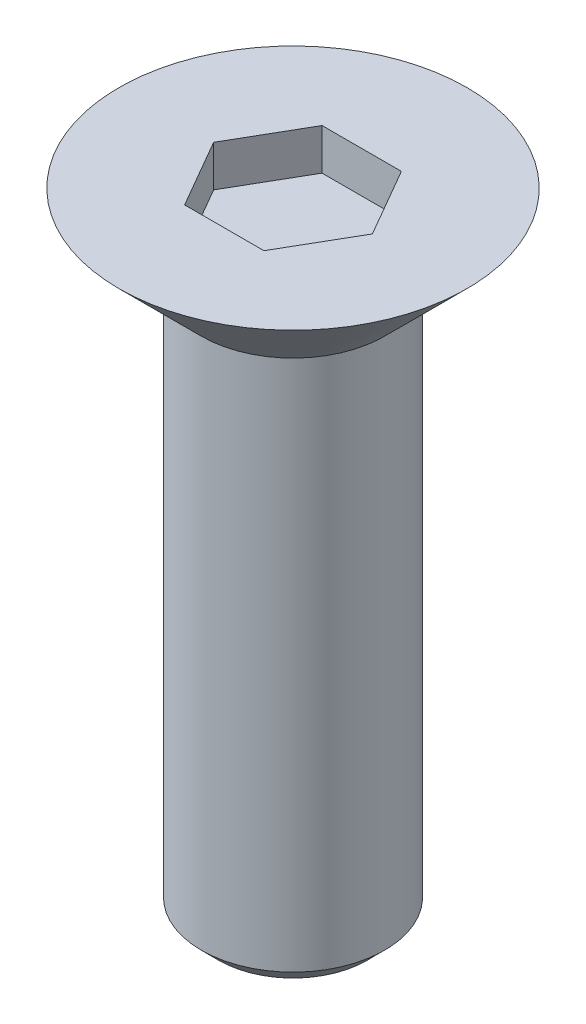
ISO-10303-21;
HEADER;
FILE_DESCRIPTION(('STEP AP214'),'2;1');
FILE_NAME('part.step','',(''),(''),'','','');
FILE_SCHEMA(('AUTOMOTIVE_DESIGN { 1 0 10303 214 1 1 1 1 }'));
ENDSEC;
DATA;
#1=APPLICATION_CONTEXT('core data for automotive mechanical design processes');
#2=APPLICATION_PROTOCOL_DEFINITION('international standard','automotive_design',2000,#1);
#3=PRODUCT_CONTEXT('',#1,'mechanical');
#4=PRODUCT('Part','Part','',(#3));
#5=PRODUCT_RELATED_PRODUCT_CATEGORY('part','',(#4));
#6=PRODUCT_DEFINITION_FORMATION('','',#4);
#7=PRODUCT_DEFINITION_CONTEXT('part definition',#1,'design');
#8=PRODUCT_DEFINITION('design','',#6,#7);
#9=PRODUCT_DEFINITION_SHAPE('','',#8);
#10=(LENGTH_UNIT() NAMED_UNIT(*) SI_UNIT(.MILLI.,.METRE.));
#11=(NAMED_UNIT(*) PLANE_ANGLE_UNIT() SI_UNIT($,.RADIAN.));
#12=(NAMED_UNIT(*) SI_UNIT($,.STERADIAN.) SOLID_ANGLE_UNIT());
#13=UNCERTAINTY_MEASURE_WITH_UNIT(LENGTH_MEASURE(1.E-05),#10,'distance_accuracy_value','');
#14=(GEOMETRIC_REPRESENTATION_CONTEXT(3) GLOBAL_UNCERTAINTY_ASSIGNED_CONTEXT((#13)) GLOBAL_UNIT_ASSIGNED_CONTEXT((#10,
#11,#12)) REPRESENTATION_CONTEXT('',''));
#15=CARTESIAN_POINT('',(0.,0.,0.));
#16=DIRECTION('',(0.,0.,1.));
#17=DIRECTION('',(1.,0.,0.));
#18=AXIS2_PLACEMENT_3D('',#15,#16,#17);
#19=CARTESIAN_POINT('',(0.,0.,0.));
#20=DIRECTION('',(0.,1.,0.));
#21=DIRECTION('',(0.,0.,1.));
#22=AXIS2_PLACEMENT_3D('',#19,#20,#21);
#23=CONICAL_SURFACE('',#22,3.8,0.78539816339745);
#24=CARTESIAN_POINT('',(0.,-1.8,0.));
#25=DIRECTION('',(0.,-1.,0.));
#26=DIRECTION('',(0.,0.,-1.));
#27=AXIS2_PLACEMENT_3D('',#24,#25,#26);
#28=CIRCLE('',#27,2.);
#29=CARTESIAN_POINT('',(0.,-1.8,2.));
#30=VERTEX_POINT('',#29);
#31=EDGE_CURVE('E133',#30,#30,#28,.T.);
#32=ORIENTED_EDGE('',*,*,#31,.F.);
#33=EDGE_LOOP('',(#32));
#34=FACE_BOUND('',#33,.T.);
#35=CARTESIAN_POINT('',(0.,0.,0.));
#36=DIRECTION('',(0.,1.,0.));
#37=DIRECTION('',(0.,0.,1.));
#38=AXIS2_PLACEMENT_3D('',#35,#36,#37);
#39=CIRCLE('',#38,3.8);
#40=CARTESIAN_POINT('',(0.,0.,3.8));
#41=VERTEX_POINT('',#40);
#42=EDGE_CURVE('E142',#41,#41,#39,.T.);
#43=ORIENTED_EDGE('',*,*,#42,.F.);
#44=EDGE_LOOP('',(#43));
#45=FACE_BOUND('',#44,.T.);
#46=ADVANCED_FACE('F31',(#34,#45),#23,.T.);
#47=CARTESIAN_POINT('',(0.,0.,0.));
#48=DIRECTION('',(0.,1.,0.));
#49=DIRECTION('',(0.,0.,1.));
#50=AXIS2_PLACEMENT_3D('',#47,#48,#49);
#51=PLANE('',#50);
#52=DIRECTION('',(0.5,0.,-0.866025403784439));
#53=VECTOR('',#52,1.);
#54=CARTESIAN_POINT('',(0.866025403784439,0.,1.5));
#55=LINE('',#54,#53);
#56=CARTESIAN_POINT('',(0.866025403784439,0.,1.5));
#57=VERTEX_POINT('',#56);
#58=CARTESIAN_POINT('',(1.73205080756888,0.,0.));
#59=VERTEX_POINT('',#58);
#60=EDGE_CURVE('E45',#57,#59,#55,.T.);
#61=ORIENTED_EDGE('',*,*,#60,.F.);
#62=DIRECTION('',(1.,0.,0.));
#63=VECTOR('',#62,1.);
#64=CARTESIAN_POINT('',(-0.86602540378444,0.,1.5));
#65=LINE('',#64,#63);
#66=CARTESIAN_POINT('',(-0.86602540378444,0.,1.5));
#67=VERTEX_POINT('',#66);
#68=EDGE_CURVE('E115',#67,#57,#65,.T.);
#69=ORIENTED_EDGE('',*,*,#68,.F.);
#70=DIRECTION('',(0.5,0.,0.866025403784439));
#71=VECTOR('',#70,1.);
#72=CARTESIAN_POINT('',(-1.73205080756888,0.,0.));
#73=LINE('',#72,#71);
#74=CARTESIAN_POINT('',(-1.73205080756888,0.,0.));
#75=VERTEX_POINT('',#74);
#76=EDGE_CURVE('E109',#75,#67,#73,.T.);
#77=ORIENTED_EDGE('',*,*,#76,.F.);
#78=DIRECTION('',(-0.5,0.,0.866025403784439));
#79=VECTOR('',#78,1.);
#80=CARTESIAN_POINT('',(-0.866025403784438,0.,-1.5));
#81=LINE('',#80,#79);
#82=CARTESIAN_POINT('',(-0.866025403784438,0.,-1.5));
#83=VERTEX_POINT('',#82);
#84=EDGE_CURVE('E107',#83,#75,#81,.T.);
#85=ORIENTED_EDGE('',*,*,#84,.F.);
#86=DIRECTION('',(-1.,0.,0.));
#87=VECTOR('',#86,1.);
#88=CARTESIAN_POINT('',(0.866025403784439,0.,-1.5));
#89=LINE('',#88,#87);
#90=CARTESIAN_POINT('',(0.866025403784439,0.,-1.5));
#91=VERTEX_POINT('',#90);
#92=EDGE_CURVE('E88',#91,#83,#89,.T.);
#93=ORIENTED_EDGE('',*,*,#92,.F.);
#94=DIRECTION('',(-0.5,0.,-0.866025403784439));
#95=VECTOR('',#94,1.);
#96=CARTESIAN_POINT('',(1.73205080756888,0.,0.));
#97=LINE('',#96,#95);
#98=EDGE_CURVE('E99',#59,#91,#97,.T.);
#99=ORIENTED_EDGE('',*,*,#98,.F.);
#100=EDGE_LOOP('',(#61,#69,#77,#85,#93,#99));
#101=FACE_BOUND('',#100,.T.);
#102=ORIENTED_EDGE('',*,*,#42,.T.);
#103=EDGE_LOOP('',(#102));
#104=FACE_BOUND('',#103,.T.);
#105=ADVANCED_FACE('F103',(#101,#104),#51,.T.);
#106=CARTESIAN_POINT('',(0.,-13.7888,0.));
#107=DIRECTION('',(0.,1.,0.));
#108=DIRECTION('',(0.,0.,1.));
#109=AXIS2_PLACEMENT_3D('',#106,#107,#108);
#110=CYLINDRICAL_SURFACE('',#109,2.);
#111=CARTESIAN_POINT('',(0.,-13.4078,0.));
#112=DIRECTION('',(0.,-1.,0.));
#113=DIRECTION('',(0.,0.,-1.));
#114=AXIS2_PLACEMENT_3D('',#111,#112,#113);
#115=CIRCLE('',#114,2.);
#116=CARTESIAN_POINT('',(0.,-13.4078,2.));
#117=VERTEX_POINT('',#116);
#118=EDGE_CURVE('E11',#117,#117,#115,.F.);
#119=CARTESIAN_POINT('',(0.,-13.4078,2.));
#120=CARTESIAN_POINT('',(0.,-13.2868854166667,2.));
#121=CARTESIAN_POINT('',(0.,-13.1659708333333,2.));
#122=CARTESIAN_POINT('',(0.,-12.9241416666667,2.));
#123=CARTESIAN_POINT('',(0.,-12.8032270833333,2.));
#124=CARTESIAN_POINT('',(0.,-12.5613979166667,2.));
#125=CARTESIAN_POINT('',(0.,-12.4404833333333,2.));
#126=CARTESIAN_POINT('',(0.,-12.1986541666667,2.));
#127=CARTESIAN_POINT('',(0.,-12.0777395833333,2.));
#128=CARTESIAN_POINT('',(0.,-11.8359104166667,2.));
#129=CARTESIAN_POINT('',(0.,-11.7149958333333,2.));
#130=CARTESIAN_POINT('',(0.,-11.4731666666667,2.));
#131=CARTESIAN_POINT('',(0.,-11.3522520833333,2.));
#132=CARTESIAN_POINT('',(0.,-11.1104229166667,2.));
#133=CARTESIAN_POINT('',(0.,-10.9895083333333,2.));
#134=CARTESIAN_POINT('',(0.,-10.7476791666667,2.));
#135=CARTESIAN_POINT('',(0.,-10.6267645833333,2.));
#136=CARTESIAN_POINT('',(0.,-10.3849354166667,2.));
#137=CARTESIAN_POINT('',(0.,-10.2640208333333,2.));
#138=CARTESIAN_POINT('',(0.,-10.0221916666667,2.));
#139=CARTESIAN_POINT('',(0.,-9.90127708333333,2.));
#140=CARTESIAN_POINT('',(0.,-9.65944791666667,2.));
#141=CARTESIAN_POINT('',(0.,-9.53853333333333,2.));
#142=CARTESIAN_POINT('',(0.,-9.29670416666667,2.));
#143=CARTESIAN_POINT('',(0.,-9.17578958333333,2.));
#144=CARTESIAN_POINT('',(0.,-8.93396041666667,2.));
#145=CARTESIAN_POINT('',(0.,-8.81304583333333,2.));
#146=CARTESIAN_POINT('',(0.,-8.57121666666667,2.));
#147=CARTESIAN_POINT('',(0.,-8.45030208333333,2.));
#148=CARTESIAN_POINT('',(0.,-8.20847291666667,2.));
#149=CARTESIAN_POINT('',(0.,-8.08755833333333,2.));
#150=CARTESIAN_POINT('',(0.,-7.84572916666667,2.));
#151=CARTESIAN_POINT('',(0.,-7.72481458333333,2.));
#152=CARTESIAN_POINT('',(0.,-7.48298541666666,2.));
#153=CARTESIAN_POINT('',(0.,-7.36207083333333,2.));
#154=CARTESIAN_POINT('',(0.,-7.12024166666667,2.));
#155=CARTESIAN_POINT('',(0.,-6.99932708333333,2.));
#156=CARTESIAN_POINT('',(0.,-6.75749791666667,2.));
#157=CARTESIAN_POINT('',(0.,-6.63658333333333,2.));
#158=CARTESIAN_POINT('',(0.,-6.39475416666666,2.));
#159=CARTESIAN_POINT('',(0.,-6.27383958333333,2.));
#160=CARTESIAN_POINT('',(0.,-6.03201041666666,2.));
#161=CARTESIAN_POINT('',(0.,-5.91109583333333,2.));
#162=CARTESIAN_POINT('',(0.,-5.66926666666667,2.));
#163=CARTESIAN_POINT('',(0.,-5.54835208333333,2.));
#164=CARTESIAN_POINT('',(0.,-5.30652291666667,2.));
#165=CARTESIAN_POINT('',(0.,-5.18560833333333,2.));
#166=CARTESIAN_POINT('',(0.,-4.94377916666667,2.));
#167=CARTESIAN_POINT('',(0.,-4.82286458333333,2.));
#168=CARTESIAN_POINT('',(0.,-4.58103541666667,2.));
#169=CARTESIAN_POINT('',(0.,-4.46012083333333,2.));
#170=CARTESIAN_POINT('',(0.,-4.21829166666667,2.));
#171=CARTESIAN_POINT('',(0.,-4.09737708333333,2.));
#172=CARTESIAN_POINT('',(0.,-3.85554791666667,2.));
#173=CARTESIAN_POINT('',(0.,-3.73463333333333,2.));
#174=CARTESIAN_POINT('',(0.,-3.49280416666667,2.));
#175=CARTESIAN_POINT('',(0.,-3.37188958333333,2.));
#176=CARTESIAN_POINT('',(0.,-3.13006041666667,2.));
#177=CARTESIAN_POINT('',(0.,-3.00914583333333,2.));
#178=CARTESIAN_POINT('',(0.,-2.76731666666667,2.));
#179=CARTESIAN_POINT('',(0.,-2.64640208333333,2.));
#180=CARTESIAN_POINT('',(0.,-2.40457291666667,2.));
#181=CARTESIAN_POINT('',(0.,-2.28365833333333,2.));
#182=CARTESIAN_POINT('',(0.,-2.04182916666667,2.));
#183=CARTESIAN_POINT('',(0.,-1.92091458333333,2.));
#184=CARTESIAN_POINT('',(0.,-1.8,2.));
#185=B_SPLINE_CURVE_WITH_KNOTS('',3,(#119,#120,#121,#122,#123,#124,#125,#126,#127,#128,#129,
#130,#131,#132,#133,#134,#135,#136,#137,#138,#139,#140,#141,#142,#143,#144,#145,#146,#147,#148,
#149,#150,#151,#152,#153,#154,#155,#156,#157,#158,#159,#160,#161,#162,#163,#164,#165,#166,#167,
#168,#169,#170,#171,#172,#173,#174,#175,#176,#177,#178,#179,#180,#181,#182,#183,#184),
.UNSPECIFIED.,.F.,.F.,(4,2,2,2,2,2,2,2,2,2,2,2,2,2,2,2,2,2,2,2,2,2,2,2,2,2,2,2,2,2,2,2,4),(0.,
0.36274375,0.7254875,1.08823125,1.450975,1.81371875,2.1764625,2.53920625,2.90195,3.26469375,
3.6274375,3.99018125,4.352925,4.71566875,5.0784125,5.44115625,5.8039,6.16664375,6.5293875,
6.89213125,7.254875,7.61761875,7.9803625,8.34310625,8.70585,9.06859375,9.4313375,9.79408125,
10.156825,10.51956875,10.8823125,11.24505625,11.6078),.UNSPECIFIED.);
#186=EDGE_CURVE('BSEAM165',#117,#30,#185,.T.);
#187=ORIENTED_EDGE('',*,*,#118,.T.);
#188=ORIENTED_EDGE('',*,*,#31,.T.);
#189=ORIENTED_EDGE('',*,*,#186,.T.);
#190=ORIENTED_EDGE('',*,*,#186,.F.);
#191=EDGE_LOOP('',(#187,#189,#188,#190));
#192=FACE_BOUND('',#191,.T.);
#193=ADVANCED_FACE('F165',(#192),#110,.T.);
#194=CARTESIAN_POINT('',(0.,-13.7888,0.));
#195=DIRECTION('',(0.,-1.,0.));
#196=DIRECTION('',(0.,0.,-1.));
#197=AXIS2_PLACEMENT_3D('',#194,#195,#196);
#198=PLANE('',#197);
#199=CARTESIAN_POINT('',(0.,-13.7888,0.));
#200=DIRECTION('',(0.,-1.,0.));
#201=DIRECTION('',(0.,0.,-1.));
#202=AXIS2_PLACEMENT_3D('',#199,#200,#201);
#203=CIRCLE('',#202,1.619);
#204=CARTESIAN_POINT('',(0.,-13.7888,-1.619));
#205=VERTEX_POINT('',#204);
#206=EDGE_CURVE('E38',#205,#205,#203,.T.);
#207=ORIENTED_EDGE('',*,*,#206,.T.);
#208=EDGE_LOOP('',(#207));
#209=FACE_BOUND('',#208,.T.);
#210=ADVANCED_FACE('F147',(#209),#198,.T.);
#211=CARTESIAN_POINT('',(0.866025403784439,-0.9,1.5));
#212=DIRECTION('',(0.866025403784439,0.,0.5));
#213=DIRECTION('',(0.5,0.,-0.866025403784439));
#214=AXIS2_PLACEMENT_3D('',#211,#212,#213);
#215=PLANE('',#214);
#216=ORIENTED_EDGE('',*,*,#60,.T.);
#217=DIRECTION('',(0.,1.,0.));
#218=VECTOR('',#217,1.);
#219=CARTESIAN_POINT('',(1.73205080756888,-0.9,0.));
#220=LINE('',#219,#218);
#221=CARTESIAN_POINT('',(1.73205080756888,-0.9,0.));
#222=VERTEX_POINT('',#221);
#223=EDGE_CURVE('E96',#222,#59,#220,.T.);
#224=ORIENTED_EDGE('',*,*,#223,.F.);
#225=DIRECTION('',(0.5,0.,-0.866025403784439));
#226=VECTOR('',#225,1.);
#227=CARTESIAN_POINT('',(0.866025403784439,-0.9,1.5));
#228=LINE('',#227,#226);
#229=CARTESIAN_POINT('',(0.866025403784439,-0.9,1.5));
#230=VERTEX_POINT('',#229);
#231=EDGE_CURVE('E117',#230,#222,#228,.T.);
#232=ORIENTED_EDGE('',*,*,#231,.F.);
#233=DIRECTION('',(0.,1.,0.));
#234=VECTOR('',#233,1.);
#235=CARTESIAN_POINT('',(0.866025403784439,-0.9,1.5));
#236=LINE('',#235,#234);
#237=EDGE_CURVE('E52',#230,#57,#236,.T.);
#238=ORIENTED_EDGE('',*,*,#237,.T.);
#239=EDGE_LOOP('',(#216,#224,#232,#238));
#240=FACE_BOUND('',#239,.T.);
#241=ADVANCED_FACE('F176',(#240),#215,.F.);
#242=CARTESIAN_POINT('',(-0.86602540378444,-0.9,1.5));
#243=DIRECTION('',(0.,0.,1.));
#244=DIRECTION('',(1.,0.,0.));
#245=AXIS2_PLACEMENT_3D('',#242,#243,#244);
#246=PLANE('',#245);
#247=ORIENTED_EDGE('',*,*,#68,.T.);
#248=ORIENTED_EDGE('',*,*,#237,.F.);
#249=DIRECTION('',(1.,0.,0.));
#250=VECTOR('',#249,1.);
#251=CARTESIAN_POINT('',(-0.86602540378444,-0.9,1.5));
#252=LINE('',#251,#250);
#253=CARTESIAN_POINT('',(-0.86602540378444,-0.9,1.5));
#254=VERTEX_POINT('',#253);
#255=EDGE_CURVE('E129',#254,#230,#252,.T.);
#256=ORIENTED_EDGE('',*,*,#255,.F.);
#257=DIRECTION('',(0.,1.,0.));
#258=VECTOR('',#257,1.);
#259=CARTESIAN_POINT('',(-0.86602540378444,-0.9,1.5));
#260=LINE('',#259,#258);
#261=EDGE_CURVE('E134',#254,#67,#260,.T.);
#262=ORIENTED_EDGE('',*,*,#261,.T.);
#263=EDGE_LOOP('',(#247,#248,#256,#262));
#264=FACE_BOUND('',#263,.T.);
#265=ADVANCED_FACE('F181',(#264),#246,.F.);
#266=CARTESIAN_POINT('',(-1.73205080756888,-0.9,0.));
#267=DIRECTION('',(-0.866025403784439,0.,0.5));
#268=DIRECTION('',(0.5,0.,0.866025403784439));
#269=AXIS2_PLACEMENT_3D('',#266,#267,#268);
#270=PLANE('',#269);
#271=ORIENTED_EDGE('',*,*,#76,.T.);
#272=ORIENTED_EDGE('',*,*,#261,.F.);
#273=DIRECTION('',(0.5,0.,0.866025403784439));
#274=VECTOR('',#273,1.);
#275=CARTESIAN_POINT('',(-1.73205080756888,-0.9,0.));
#276=LINE('',#275,#274);
#277=CARTESIAN_POINT('',(-1.73205080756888,-0.9,0.));
#278=VERTEX_POINT('',#277);
#279=EDGE_CURVE('E126',#278,#254,#276,.T.);
#280=ORIENTED_EDGE('',*,*,#279,.F.);
#281=DIRECTION('',(0.,1.,0.));
#282=VECTOR('',#281,1.);
#283=CARTESIAN_POINT('',(-1.73205080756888,-0.9,0.));
#284=LINE('',#283,#282);
#285=EDGE_CURVE('E136',#278,#75,#284,.T.);
#286=ORIENTED_EDGE('',*,*,#285,.T.);
#287=EDGE_LOOP('',(#271,#272,#280,#286));
#288=FACE_BOUND('',#287,.T.);
#289=ADVANCED_FACE('F189',(#288),#270,.F.);
#290=CARTESIAN_POINT('',(-0.866025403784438,-0.9,-1.5));
#291=DIRECTION('',(-0.866025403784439,0.,-0.5));
#292=DIRECTION('',(-0.5,0.,0.866025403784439));
#293=AXIS2_PLACEMENT_3D('',#290,#291,#292);
#294=PLANE('',#293);
#295=ORIENTED_EDGE('',*,*,#84,.T.);
#296=ORIENTED_EDGE('',*,*,#285,.F.);
#297=DIRECTION('',(-0.5,0.,0.866025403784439));
#298=VECTOR('',#297,1.);
#299=CARTESIAN_POINT('',(-0.866025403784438,-0.9,-1.5));
#300=LINE('',#299,#298);
#301=CARTESIAN_POINT('',(-0.866025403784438,-0.9,-1.5));
#302=VERTEX_POINT('',#301);
#303=EDGE_CURVE('E123',#302,#278,#300,.T.);
#304=ORIENTED_EDGE('',*,*,#303,.F.);
#305=DIRECTION('',(0.,1.,0.));
#306=VECTOR('',#305,1.);
#307=CARTESIAN_POINT('',(-0.866025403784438,-0.9,-1.5));
#308=LINE('',#307,#306);
#309=EDGE_CURVE('E95',#302,#83,#308,.T.);
#310=ORIENTED_EDGE('',*,*,#309,.T.);
#311=EDGE_LOOP('',(#295,#296,#304,#310));
#312=FACE_BOUND('',#311,.T.);
#313=ADVANCED_FACE('F186',(#312),#294,.F.);
#314=CARTESIAN_POINT('',(0.866025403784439,-0.9,-1.5));
#315=DIRECTION('',(0.,0.,-1.));
#316=DIRECTION('',(-1.,0.,0.));
#317=AXIS2_PLACEMENT_3D('',#314,#315,#316);
#318=PLANE('',#317);
#319=ORIENTED_EDGE('',*,*,#92,.T.);
#320=ORIENTED_EDGE('',*,*,#309,.F.);
#321=DIRECTION('',(-1.,0.,0.));
#322=VECTOR('',#321,1.);
#323=CARTESIAN_POINT('',(0.866025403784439,-0.9,-1.5));
#324=LINE('',#323,#322);
#325=CARTESIAN_POINT('',(0.866025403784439,-0.9,-1.5));
#326=VERTEX_POINT('',#325);
#327=EDGE_CURVE('E91',#326,#302,#324,.T.);
#328=ORIENTED_EDGE('',*,*,#327,.F.);
#329=DIRECTION('',(0.,1.,0.));
#330=VECTOR('',#329,1.);
#331=CARTESIAN_POINT('',(0.866025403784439,-0.9,-1.5));
#332=LINE('',#331,#330);
#333=EDGE_CURVE('E84',#326,#91,#332,.T.);
#334=ORIENTED_EDGE('',*,*,#333,.T.);
#335=EDGE_LOOP('',(#319,#320,#328,#334));
#336=FACE_BOUND('',#335,.T.);
#337=ADVANCED_FACE('F86',(#336),#318,.F.);
#338=CARTESIAN_POINT('',(1.73205080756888,-0.9,0.));
#339=DIRECTION('',(0.866025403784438,0.,-0.5));
#340=DIRECTION('',(-0.5,0.,-0.866025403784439));
#341=AXIS2_PLACEMENT_3D('',#338,#339,#340);
#342=PLANE('',#341);
#343=ORIENTED_EDGE('',*,*,#98,.T.);
#344=ORIENTED_EDGE('',*,*,#333,.F.);
#345=DIRECTION('',(-0.5,0.,-0.866025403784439));
#346=VECTOR('',#345,1.);
#347=CARTESIAN_POINT('',(1.73205080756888,-0.9,0.));
#348=LINE('',#347,#346);
#349=EDGE_CURVE('E120',#222,#326,#348,.T.);
#350=ORIENTED_EDGE('',*,*,#349,.F.);
#351=ORIENTED_EDGE('',*,*,#223,.T.);
#352=EDGE_LOOP('',(#343,#344,#350,#351));
#353=FACE_BOUND('',#352,.T.);
#354=ADVANCED_FACE('F100',(#353),#342,.F.);
#355=CARTESIAN_POINT('',(2.59807621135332,-0.9,-1.5));
#356=DIRECTION('',(0.,1.,0.));
#357=DIRECTION('',(0.,0.,1.));
#358=AXIS2_PLACEMENT_3D('',#355,#356,#357);
#359=PLANE('',#358);
#360=ORIENTED_EDGE('',*,*,#231,.T.);
#361=ORIENTED_EDGE('',*,*,#349,.T.);
#362=ORIENTED_EDGE('',*,*,#327,.T.);
#363=ORIENTED_EDGE('',*,*,#303,.T.);
#364=ORIENTED_EDGE('',*,*,#279,.T.);
#365=ORIENTED_EDGE('',*,*,#255,.T.);
#366=EDGE_LOOP('',(#360,#361,#362,#363,#364,#365));
#367=FACE_BOUND('',#366,.T.);
#368=ADVANCED_FACE('F151',(#367),#359,.T.);
#369=CARTESIAN_POINT('',(0.,-13.7888,0.));
#370=DIRECTION('',(0.,1.,0.));
#371=DIRECTION('',(0.,0.,1.));
#372=AXIS2_PLACEMENT_3D('',#369,#370,#371);
#373=CONICAL_SURFACE('',#372,1.619,0.785398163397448);
#374=ORIENTED_EDGE('',*,*,#118,.F.);
#375=EDGE_LOOP('',(#374));
#376=FACE_BOUND('',#375,.T.);
#377=ORIENTED_EDGE('',*,*,#206,.F.);
#378=EDGE_LOOP('',(#377));
#379=FACE_BOUND('',#378,.T.);
#380=ADVANCED_FACE('F149',(#376,#379),#373,.T.);
#381=CLOSED_SHELL('',(#46,#105,#193,#210,#241,#265,#289,#313,#337,#354,#368,#380));
#382=MANIFOLD_SOLID_BREP('B2',#381);
#383=ADVANCED_BREP_SHAPE_REPRESENTATION('',(#18,#382),#14);
#384=SHAPE_DEFINITION_REPRESENTATION(#9,#383);
ENDSEC;
END-ISO-10303-21;
